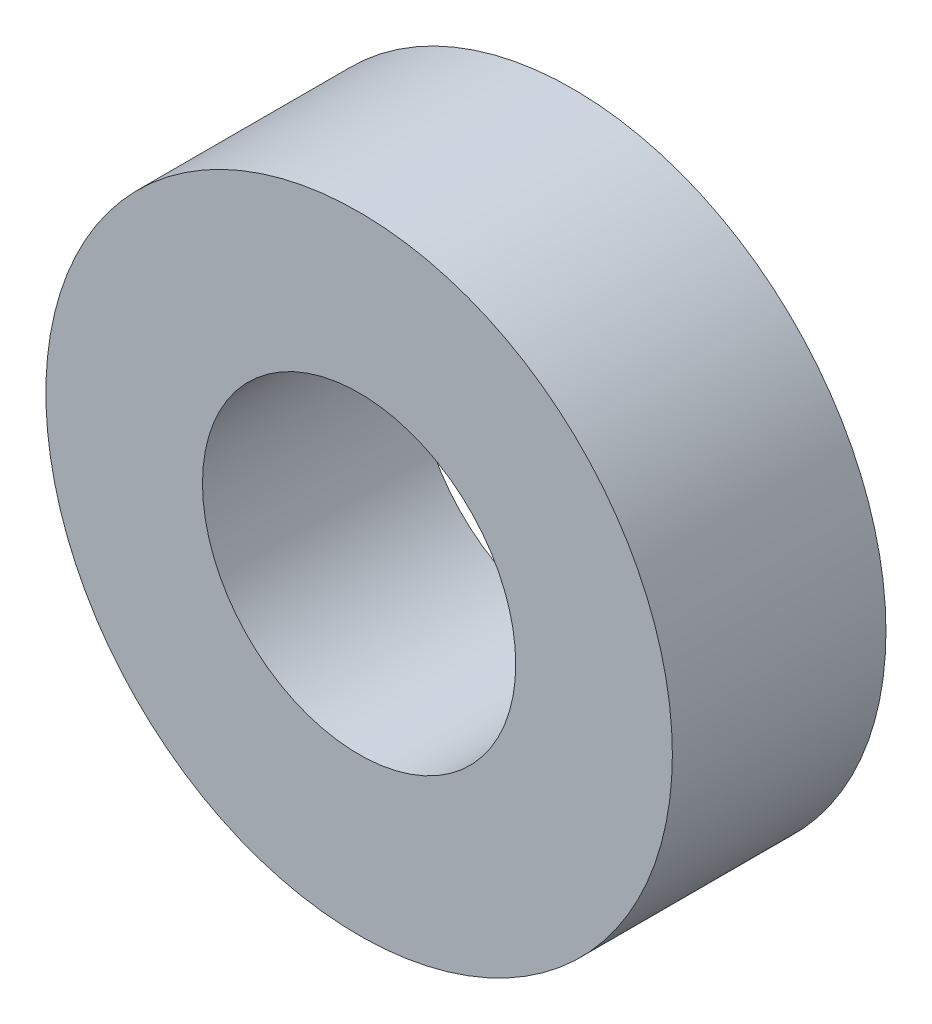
from build123d import *

# Parameters (mm, degrees)
SKETCH1_R           = 139.7
SKETCH1_R_2         = 69.85
BOSS_EXTRUDE1_DEPTH = 95.25


with BuildPart() as part:
    # Sketch1 → Boss-Extrude1 (new body)
    with BuildSketch(Plane.XY):
        Circle(SKETCH1_R)
        Circle(SKETCH1_R_2, mode=Mode.SUBTRACT)
    extrude(amount=BOSS_EXTRUDE1_DEPTH)


solid = part.part
